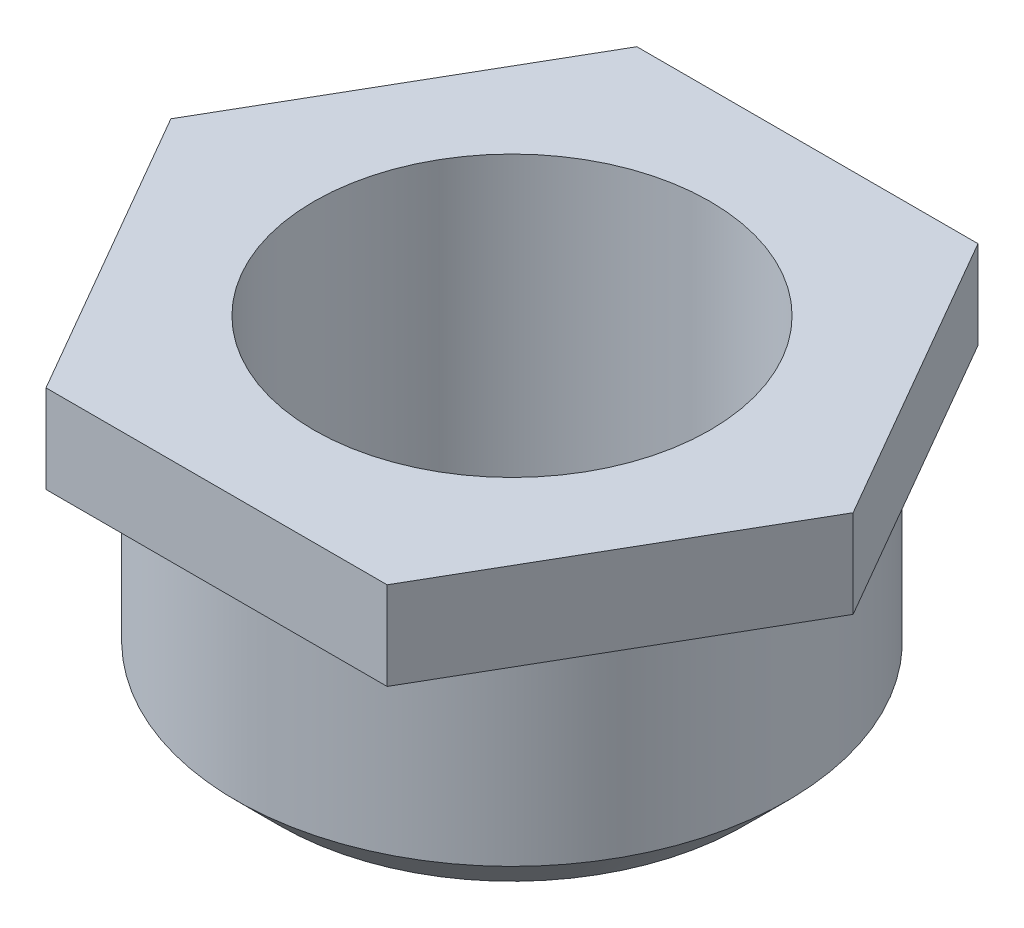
from build123d import *

# Parameters (mm, degrees)
ESQUISSE2_OUTSIDE_W = 22.128
ESQUISSE2_OUTSIDE_H = 22.128
FORME_CROU_DEPTH    = 10
CHANFREIN_INF_SIZE  = 1


with BuildPart() as part:
    # Esquisse1 → Base-R_volution (revolve)
    with BuildSketch(Plane.XY, mode=Mode.PRIVATE) as base_r_volution_sk:
        Polygon((4.5, 0), (6.271, 0), (6.271, 5.4), (7.75, 5.4), (7.75, 7.4), (4.5, 7.4), align=None)
    revolve(base_r_volution_sk.sketch.rotate(Axis((0, 0, 0), (0, 1, 0)), 90), axis=Axis((0, 0, 0), (0, 1, 0)))

    # Esquisse2 outside → Forme _crou (cut)
    with BuildSketch(Plane(origin=(0, 7.4, 0), x_dir=(-1, 0, 0), z_dir=(0, 1, 0))):
        Rectangle(ESQUISSE2_OUTSIDE_W, ESQUISSE2_OUTSIDE_H)
        Polygon((-7.75, 0), (-3.875, -6.711696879), (3.875, -6.711696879), (7.75, 0), (3.875, 6.711696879), (-3.875, 6.711696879), align=None, mode=Mode.SUBTRACT)
    extrude(amount=-FORME_CROU_DEPTH, mode=Mode.SUBTRACT)

    # Chanfrein inf
    chanfrein_inf_edges = [part.edges().sort_by_distance(p)[0] for p in [
        (0, 0, 6.271),
    ]]
    chamfer(chanfrein_inf_edges, length=CHANFREIN_INF_SIZE)


solid = part.part
